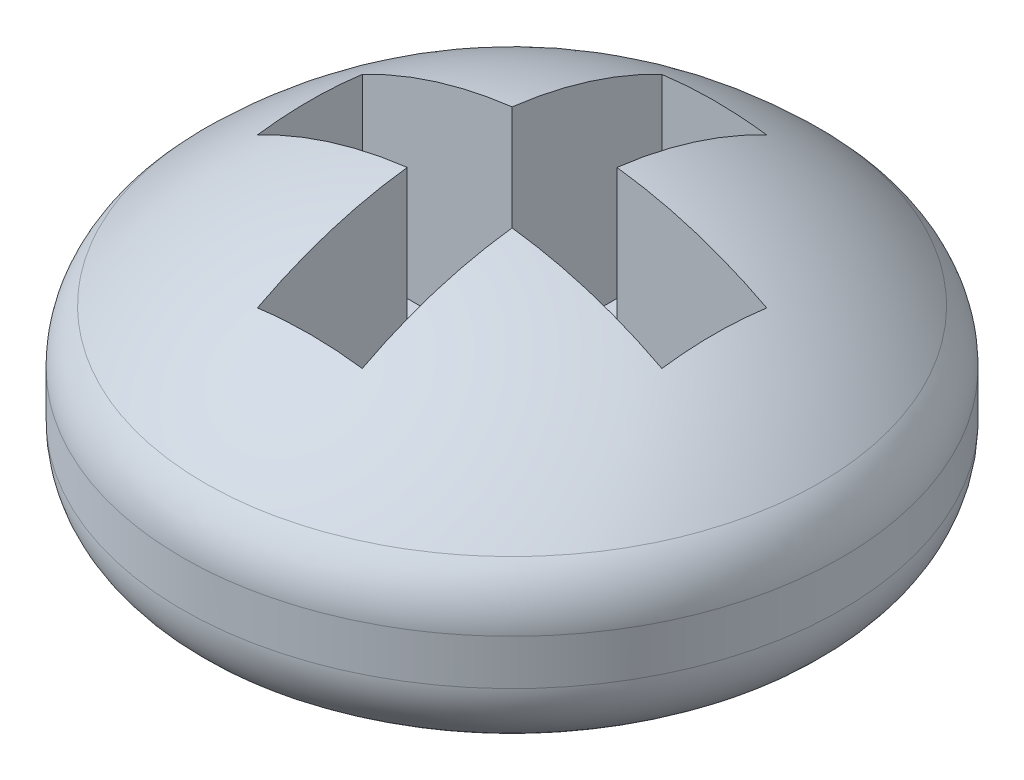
ISO-10303-21;
HEADER;
FILE_DESCRIPTION(('STEP AP214'),'2;1');
FILE_NAME('part.step','',(''),(''),'','','');
FILE_SCHEMA(('AUTOMOTIVE_DESIGN { 1 0 10303 214 1 1 1 1 }'));
ENDSEC;
DATA;
#1=APPLICATION_CONTEXT('core data for automotive mechanical design processes');
#2=APPLICATION_PROTOCOL_DEFINITION('international standard','automotive_design',2000,#1);
#3=PRODUCT_CONTEXT('',#1,'mechanical');
#4=PRODUCT('Part','Part','',(#3));
#5=PRODUCT_RELATED_PRODUCT_CATEGORY('part','',(#4));
#6=PRODUCT_DEFINITION_FORMATION('','',#4);
#7=PRODUCT_DEFINITION_CONTEXT('part definition',#1,'design');
#8=PRODUCT_DEFINITION('design','',#6,#7);
#9=PRODUCT_DEFINITION_SHAPE('','',#8);
#10=(LENGTH_UNIT() NAMED_UNIT(*) SI_UNIT(.MILLI.,.METRE.));
#11=(NAMED_UNIT(*) PLANE_ANGLE_UNIT() SI_UNIT($,.RADIAN.));
#12=(NAMED_UNIT(*) SI_UNIT($,.STERADIAN.) SOLID_ANGLE_UNIT());
#13=UNCERTAINTY_MEASURE_WITH_UNIT(LENGTH_MEASURE(1.E-05),#10,'distance_accuracy_value','');
#14=(GEOMETRIC_REPRESENTATION_CONTEXT(3) GLOBAL_UNCERTAINTY_ASSIGNED_CONTEXT((#13)) GLOBAL_UNIT_ASSIGNED_CONTEXT((#10,
#11,#12)) REPRESENTATION_CONTEXT('',''));
#15=CARTESIAN_POINT('',(0.,0.,0.));
#16=DIRECTION('',(0.,0.,1.));
#17=DIRECTION('',(1.,0.,0.));
#18=AXIS2_PLACEMENT_3D('',#15,#16,#17);
#19=CARTESIAN_POINT('',(0.,29.3099999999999,0.));
#20=DIRECTION('',(-1.,0.,0.));
#21=DIRECTION('',(0.,0.,-1.));
#22=AXIS2_PLACEMENT_3D('',#19,#20,#21);
#23=SPHERICAL_SURFACE('',#22,2.92);
#24=CARTESIAN_POINT('',(0.231169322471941,31.0323240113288,-2.18782100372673));
#25=CARTESIAN_POINT('',(0.231169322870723,31.2413439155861,-2.18782100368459));
#26=CARTESIAN_POINT('',(0.21553803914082,31.3881760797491,-2.03988419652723));
#27=CARTESIAN_POINT('',(0.108152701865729,31.0323240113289,-2.20081917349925));
#28=CARTESIAN_POINT('',(0.108152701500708,31.2413439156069,-2.20081917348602));
#29=CARTESIAN_POINT('',(0.100839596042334,31.3881760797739,-2.05200345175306));
#30=CARTESIAN_POINT('',(-0.015962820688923,31.0323240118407,-2.2034171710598));
#31=CARTESIAN_POINT('',(-0.0159628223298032,31.2413439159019,-2.20341717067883));
#32=CARTESIAN_POINT('',(-0.0148834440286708,31.3881760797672,-2.05442577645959));
#33=CARTESIAN_POINT('',(-0.26286840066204,31.0323240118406,-2.18773907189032));
#34=CARTESIAN_POINT('',(-0.262868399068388,31.2413439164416,-2.18773907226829));
#35=CARTESIAN_POINT('',(-0.245093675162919,31.3881760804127,-2.0398078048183));
#36=CARTESIAN_POINT('',(-0.385658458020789,31.0323240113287,-2.16946297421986));
#37=CARTESIAN_POINT('',(-0.385658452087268,31.2413439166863,-2.16946297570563));
#38=CARTESIAN_POINT('',(-0.359580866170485,31.3881760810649,-2.02276750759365));
#39=CARTESIAN_POINT('',(-0.626427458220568,31.0323240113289,-2.11255548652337));
#40=CARTESIAN_POINT('',(-0.626427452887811,31.2413439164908,-2.11255548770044));
#41=CARTESIAN_POINT('',(-0.584069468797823,31.388176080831,-1.96970800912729));
#42=CARTESIAN_POINT('',(-0.744406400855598,31.0323240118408,-2.07392409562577));
#43=CARTESIAN_POINT('',(-0.744406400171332,31.2413439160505,-2.07392409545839));
#44=CARTESIAN_POINT('',(-0.694070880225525,31.3881760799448,-1.93368880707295));
#45=CARTESIAN_POINT('',(-0.972204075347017,31.0323240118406,-1.97740265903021));
#46=CARTESIAN_POINT('',(-0.972204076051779,31.241343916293,-1.97740265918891));
#47=CARTESIAN_POINT('',(-0.906465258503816,31.3881760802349,-1.8436939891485));
#48=CARTESIAN_POINT('',(-1.08202280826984,31.0323240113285,-1.91951261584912));
#49=CARTESIAN_POINT('',(-1.08202280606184,31.2413439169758,-1.91951261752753));
#50=CARTESIAN_POINT('',(-1.00885822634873,31.3881760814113,-1.78971837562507));
#51=CARTESIAN_POINT('',(-1.29038263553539,31.0323240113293,-1.78611721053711));
#52=CARTESIAN_POINT('',(-1.29038263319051,31.2413439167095,-1.78611721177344));
#53=CARTESIAN_POINT('',(-1.20312910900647,31.3881760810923,-1.66534294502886));
#54=CARTESIAN_POINT('',(-1.38892373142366,31.0323240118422,-1.71061185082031));
#55=CARTESIAN_POINT('',(-1.38892373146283,31.2413439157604,-1.71061185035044));
#56=CARTESIAN_POINT('',(-1.29500702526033,31.3881760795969,-1.59494313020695));
#57=CARTESIAN_POINT('',(-1.57193104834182,31.0323240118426,-1.54412914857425));
#58=CARTESIAN_POINT('',(-1.5719310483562,31.2413439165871,-1.54412914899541));
#59=CARTESIAN_POINT('',(-1.4656396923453,31.3881760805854,-1.43971771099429));
#60=CARTESIAN_POINT('',(-1.65639726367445,31.0323240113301,-1.45315179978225));
#61=CARTESIAN_POINT('',(-1.6563972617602,31.241343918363,-1.45315180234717));
#62=CARTESIAN_POINT('',(-1.54439443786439,31.3881760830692,-1.35489210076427));
#63=CARTESIAN_POINT('',(-1.80885704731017,31.0323240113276,-1.25830768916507));
#64=CARTESIAN_POINT('',(-1.80885704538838,31.2413439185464,-1.25830769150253));
#65=CARTESIAN_POINT('',(-1.6865451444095,31.3881760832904,-1.17322302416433));
#66=CARTESIAN_POINT('',(-1.87685061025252,31.0323240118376,-1.15444092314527));
#67=CARTESIAN_POINT('',(-1.87685060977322,31.2413439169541,-1.15444092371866));
#68=CARTESIAN_POINT('',(-1.74994110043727,31.3881760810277,-1.07637955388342));
#69=CARTESIAN_POINT('',(-1.99443485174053,31.032324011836,-0.936766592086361));
#70=CARTESIAN_POINT('',(-1.99443485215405,31.2413439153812,-0.936766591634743));
#71=CARTESIAN_POINT('',(-1.85957449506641,31.3881760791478,-0.873423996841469));
#72=CARTESIAN_POINT('',(-2.04402554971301,31.0323240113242,-0.822959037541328));
#73=CARTESIAN_POINT('',(-2.04402554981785,31.2413439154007,-0.822959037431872));
#74=CARTESIAN_POINT('',(-1.905811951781,31.3881760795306,-0.767311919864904));
#75=CARTESIAN_POINT('',(-2.12339641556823,31.0323240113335,-0.588633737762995));
#76=CARTESIAN_POINT('',(-2.12339641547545,31.2413439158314,-0.588633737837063));
#77=CARTESIAN_POINT('',(-1.97981589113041,31.3881760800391,-0.548831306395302));
#78=CARTESIAN_POINT('',(-2.15317659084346,31.0323240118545,-0.468115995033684));
#79=CARTESIAN_POINT('',(-2.1531765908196,31.2413439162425,-0.468115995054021));
#80=CARTESIAN_POINT('',(-2.00758238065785,31.3881760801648,-0.43646277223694));
#81=CARTESIAN_POINT('',(-2.19208110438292,31.0323240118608,-0.223791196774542));
#82=CARTESIAN_POINT('',(-2.19208110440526,31.2413439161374,-0.223791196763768));
#83=CARTESIAN_POINT('',(-2.04385623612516,31.3881760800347,-0.208658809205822));
#84=CARTESIAN_POINT('',(-2.20120540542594,31.0323240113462,-0.0999841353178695));
#85=CARTESIAN_POINT('',(-2.20120540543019,31.2413439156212,-0.0999841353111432));
#86=CARTESIAN_POINT('',(-2.05236356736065,31.3881760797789,-0.0932233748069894));
#87=CARTESIAN_POINT('',(-2.19853905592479,31.0323240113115,0.147404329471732));
#88=CARTESIAN_POINT('',(-2.19853905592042,31.2413439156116,0.147404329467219));
#89=CARTESIAN_POINT('',(-2.04987751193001,31.3881760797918,0.137437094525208));
#90=CARTESIAN_POINT('',(-2.18674844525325,31.0323240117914,0.27098573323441));
#91=CARTESIAN_POINT('',(-2.18674844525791,31.2413439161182,0.270985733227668));
#92=CARTESIAN_POINT('',(-2.03888416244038,31.3881760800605,0.252662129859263));
#93=CARTESIAN_POINT('',(-2.14258698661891,31.032324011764,0.514415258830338));
#94=CARTESIAN_POINT('',(-2.14258698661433,31.2413439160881,0.514415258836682));
#95=CARTESIAN_POINT('',(-1.99770882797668,31.3881760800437,0.479631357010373));
#96=CARTESIAN_POINT('',(-2.11021609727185,31.0323240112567,0.634263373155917));
#97=CARTESIAN_POINT('',(-2.11021609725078,31.2413439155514,0.634263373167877));
#98=CARTESIAN_POINT('',(-1.96752680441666,31.3881760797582,0.591375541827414));
#99=CARTESIAN_POINT('',(-2.02581224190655,31.032324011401,0.866826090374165));
#100=CARTESIAN_POINT('',(-2.02581224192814,31.2413439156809,0.866826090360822));
#101=CARTESIAN_POINT('',(-1.88883019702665,31.3881760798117,0.80821275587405));
#102=CARTESIAN_POINT('',(-1.97377890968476,31.0323240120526,0.979540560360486));
#103=CARTESIAN_POINT('',(-1.97377890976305,31.2413439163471,0.979540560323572));
#104=CARTESIAN_POINT('',(-1.84031527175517,31.3881760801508,0.913305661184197));
#105=CARTESIAN_POINT('',(-1.85152947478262,31.0323240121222,1.19462957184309));
#106=CARTESIAN_POINT('',(-1.85152947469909,31.2413439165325,1.19462957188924));
#107=CARTESIAN_POINT('',(-1.7263321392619,31.3881760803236,1.11385071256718));
#108=CARTESIAN_POINT('',(-1.78131408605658,31.0323240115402,1.29700451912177));
#109=CARTESIAN_POINT('',(-1.78131408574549,31.2413439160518,1.29700451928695));
#110=CARTESIAN_POINT('',(-1.66086459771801,31.3881760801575,1.20930323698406));
#111=CARTESIAN_POINT('',(-1.62469149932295,31.0323240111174,1.48851624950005));
#112=CARTESIAN_POINT('',(-1.62469149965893,31.2413439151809,1.48851624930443));
#113=CARTESIAN_POINT('',(-1.51483257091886,31.388176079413,1.38786526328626));
#114=CARTESIAN_POINT('',(-1.53828382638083,31.0323240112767,1.57765264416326));
#115=CARTESIAN_POINT('',(-1.53828382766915,31.2413439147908,1.57765264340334));
#116=CARTESIAN_POINT('',(-1.4342676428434,31.3881760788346,1.47097440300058));
#117=CARTESIAN_POINT('',(-1.35172855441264,31.0323240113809,1.74015211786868));
#118=CARTESIAN_POINT('',(-1.35172855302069,31.2413439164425,1.74015211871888));
#119=CARTESIAN_POINT('',(-1.26032692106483,31.3881760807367,1.62248593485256));
#120=CARTESIAN_POINT('',(-1.25158122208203,31.0323240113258,1.81351550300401));
#121=CARTESIAN_POINT('',(-1.25158121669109,31.2413439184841,1.81351550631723));
#122=CARTESIAN_POINT('',(-1.16695137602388,31.3881760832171,1.69088861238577));
#123=CARTESIAN_POINT('',(-1.04033929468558,31.0323240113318,1.94242650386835));
#124=CARTESIAN_POINT('',(-1.04033928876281,31.2413439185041,1.9424265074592));
#125=CARTESIAN_POINT('',(-0.969993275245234,31.3881760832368,1.81108286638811));
#126=CARTESIAN_POINT('',(-0.92923804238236,31.0323240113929,1.99796319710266));
#127=CARTESIAN_POINT('',(-0.929238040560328,31.2413439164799,1.99796319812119));
#128=CARTESIAN_POINT('',(-0.866404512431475,31.388176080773,1.86286425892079));
#129=CARTESIAN_POINT('',(-0.69937579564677,31.0323240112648,2.08953200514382));
#130=CARTESIAN_POINT('',(-0.699375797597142,31.2413439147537,2.08953200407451));
#131=CARTESIAN_POINT('',(-0.652085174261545,31.3881760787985,1.94824133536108));
#132=CARTESIAN_POINT('',(-0.580624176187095,31.0323240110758,2.12558750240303));
#133=CARTESIAN_POINT('',(-0.5806241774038,31.2413439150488,2.12558750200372));
#134=CARTESIAN_POINT('',(-0.541363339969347,31.3881760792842,1.98185882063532));
#135=CARTESIAN_POINT('',(-0.384263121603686,31.0323240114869,2.16756087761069));
#136=CARTESIAN_POINT('',(-0.384263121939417,31.2413439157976,2.16756087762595));
#137=CARTESIAN_POINT('',(-0.358279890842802,31.388176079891,2.0209940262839));
#138=CARTESIAN_POINT('',(-0.307929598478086,31.0323240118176,2.17971036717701));
#139=CARTESIAN_POINT('',(-0.307929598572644,31.2413439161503,2.17971036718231));
#140=CARTESIAN_POINT('',(-0.287107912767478,31.3881760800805,2.03232198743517));
#141=CARTESIAN_POINT('',(-0.154409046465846,31.0323240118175,2.19593164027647));
#142=CARTESIAN_POINT('',(-0.154409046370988,31.2413439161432,2.19593164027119));
#143=CARTESIAN_POINT('',(-0.143968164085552,31.388176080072,2.04744640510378));
#144=CARTESIAN_POINT('',(-0.0772220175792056,31.0323240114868,2.20000342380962));
#145=CARTESIAN_POINT('',(-0.0772220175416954,31.2413439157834,2.20000342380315));
#146=CARTESIAN_POINT('',(-0.0720003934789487,31.388176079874,2.05124286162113));
#147=CARTESIAN_POINT('',(0.123574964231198,31.0323240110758,2.19999452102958));
#148=CARTESIAN_POINT('',(0.123574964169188,31.2413439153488,2.19999452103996));
#149=CARTESIAN_POINT('',(0.115219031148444,31.388176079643,2.05123456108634));
#150=CARTESIAN_POINT('',(0.247239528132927,31.0323240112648,2.18955317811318));
#151=CARTESIAN_POINT('',(0.247239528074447,31.2413439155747,2.18955317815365));
#152=CARTESIAN_POINT('',(0.230521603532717,31.3881760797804,2.04149924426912));
#153=CARTESIAN_POINT('',(0.491162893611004,31.0323240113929,2.14804545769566));
#154=CARTESIAN_POINT('',(0.491162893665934,31.2413439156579,2.14804545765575));
#155=CARTESIAN_POINT('',(0.457951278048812,31.3881760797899,2.00279820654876));
#156=CARTESIAN_POINT('',(0.611417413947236,31.0323240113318,2.1169542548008));
#157=CARTESIAN_POINT('',(0.611417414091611,31.2413439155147,2.11695425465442));
#158=CARTESIAN_POINT('',(0.570074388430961,31.3881760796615,1.97380933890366));
#159=CARTESIAN_POINT('',(0.844935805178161,31.0323240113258,2.03503747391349));
#160=CARTESIAN_POINT('',(0.84493580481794,31.2413439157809,2.03503747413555));
#161=CARTESIAN_POINT('',(0.787802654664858,31.3881760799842,1.89743163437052));
#162=CARTESIAN_POINT('',(0.958203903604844,31.0323240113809,1.98422396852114));
#163=CARTESIAN_POINT('',(0.95820390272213,31.2413439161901,1.98422396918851));
#164=CARTESIAN_POINT('',(0.893411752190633,31.3881760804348,1.85005405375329));
#165=CARTESIAN_POINT('',(1.17460045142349,31.0323240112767,1.86430114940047));
#166=CARTESIAN_POINT('',(1.1746004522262,31.2413439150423,1.86430114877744));
#167=CARTESIAN_POINT('',(1.095175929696,31.3881760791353,1.73824021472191));
#168=CARTESIAN_POINT('',(1.27772870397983,31.0323240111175,1.79519148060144));
#169=CARTESIAN_POINT('',(1.27772870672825,31.2413439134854,1.79519147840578));
#170=CARTESIAN_POINT('',(1.19133082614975,31.3881760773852,1.67380362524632));
#171=CARTESIAN_POINT('',(1.47091683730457,31.0323240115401,1.6406414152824));
#172=CARTESIAN_POINT('',(1.47091683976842,31.2413439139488,1.64064141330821));
#173=CARTESIAN_POINT('',(1.37145589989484,31.3881760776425,1.529703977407));
#174=CARTESIAN_POINT('',(1.56097710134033,31.0323240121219,1.555201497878));
#175=CARTESIAN_POINT('',(1.56097710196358,31.241343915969,1.55520149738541));
#176=CARTESIAN_POINT('',(1.45542643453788,31.3881760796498,1.45004136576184));
#177=CARTESIAN_POINT('',(1.72547855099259,31.0323240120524,1.3704111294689));
#178=CARTESIAN_POINT('',(1.72547855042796,31.2413439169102,1.37041112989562));
#179=CARTESIAN_POINT('',(1.60880456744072,31.3881760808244,1.27774621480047));
#180=CARTESIAN_POINT('',(1.79991912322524,31.0323240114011,1.27106013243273));
#181=CARTESIAN_POINT('',(1.79991912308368,31.2413439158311,1.27106013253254));
#182=CARTESIAN_POINT('',(1.67821159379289,31.3881760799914,1.18511316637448));
#183=CARTESIAN_POINT('',(1.93106255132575,31.032324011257,1.06127255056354));
#184=CARTESIAN_POINT('',(1.93106255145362,31.2413439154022,1.0612725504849));
#185=CARTESIAN_POINT('',(1.80048732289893,31.3881760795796,0.98951107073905));
#186=CARTESIAN_POINT('',(1.98776573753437,31.0323240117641,0.950836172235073));
#187=CARTESIAN_POINT('',(1.98776573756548,31.2413439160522,0.950836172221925));
#188=CARTESIAN_POINT('',(1.8533563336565,31.3881760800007,0.886542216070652));
#189=CARTESIAN_POINT('',(2.08182647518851,31.0323240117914,0.722011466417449));
#190=CARTESIAN_POINT('',(2.08182647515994,31.2413439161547,0.72201146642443));
#191=CARTESIAN_POINT('',(1.94105684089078,31.3881760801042,0.673190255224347));
#192=CARTESIAN_POINT('',(2.11918406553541,31.0323240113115,0.603623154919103));
#193=CARTESIAN_POINT('',(2.1191840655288,31.2413439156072,0.603623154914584));
#194=CARTESIAN_POINT('',(1.97588837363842,31.3881760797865,0.562807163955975));
#195=CARTESIAN_POINT('',(2.17349338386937,31.0323240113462,0.36225484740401));
#196=CARTESIAN_POINT('',(2.17349338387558,31.2413439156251,0.362254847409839));
#197=CARTESIAN_POINT('',(2.02652538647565,31.3881760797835,0.337759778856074));
#198=CARTESIAN_POINT('',(2.1904450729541,31.0323240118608,0.239274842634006));
#199=CARTESIAN_POINT('',(2.19044507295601,31.2413439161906,0.23927484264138));
#200=CARTESIAN_POINT('',(2.04233083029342,31.3881760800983,0.223095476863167));
#201=CARTESIAN_POINT('',(2.20346123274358,31.0323240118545,-0.0077853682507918));
#202=CARTESIAN_POINT('',(2.20346123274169,31.241343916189,-0.00778536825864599));
#203=CARTESIAN_POINT('',(2.05446685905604,31.3881760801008,-0.00725893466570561));
#204=CARTESIAN_POINT('',(2.19952574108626,31.0323240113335,-0.131865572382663));
#205=CARTESIAN_POINT('',(2.19952574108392,31.2413439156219,-0.131865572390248));
#206=CARTESIAN_POINT('',(2.05079747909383,31.3881760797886,-0.122949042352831));
#207=CARTESIAN_POINT('',(2.17087933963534,31.0323240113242,-0.377604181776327));
#208=CARTESIAN_POINT('',(2.17087933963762,31.2413439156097,-0.37760418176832));
#209=CARTESIAN_POINT('',(2.02408809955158,31.3881760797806,-0.352071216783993));
#210=CARTESIAN_POINT('',(2.14616842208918,31.0323240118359,-0.499262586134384));
#211=CARTESIAN_POINT('',(2.14616842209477,31.2413439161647,-0.49926258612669));
#212=CARTESIAN_POINT('',(2.00104809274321,31.3881760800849,-0.465503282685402));
#213=CARTESIAN_POINT('',(2.07667259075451,31.0323240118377,-0.736704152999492));
#214=CARTESIAN_POINT('',(2.07667259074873,31.2413439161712,-0.736704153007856));
#215=CARTESIAN_POINT('',(1.93625145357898,31.3881760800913,-0.686889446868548));
#216=CARTESIAN_POINT('',(2.031887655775,31.0323240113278,-0.852487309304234));
#217=CARTESIAN_POINT('',(2.03188765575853,31.2413439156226,-0.852487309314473));
#218=CARTESIAN_POINT('',(1.89449480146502,31.3881760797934,-0.794843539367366));
#219=CARTESIAN_POINT('',(1.92351511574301,31.0323240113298,-1.07489145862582));
#220=CARTESIAN_POINT('',(1.92351511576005,31.24134391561,-1.07489145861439));
#221=CARTESIAN_POINT('',(1.79345023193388,31.3881760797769,-1.00220909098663));
#222=CARTESIAN_POINT('',(1.85992751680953,31.0323240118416,-1.18151245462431));
#223=CARTESIAN_POINT('',(1.85992751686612,31.2413439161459,-1.18151245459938));
#224=CARTESIAN_POINT('',(1.73416232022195,31.3881760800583,-1.10162055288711));
#225=CARTESIAN_POINT('',(1.71575473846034,31.0323240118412,-1.38256562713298));
#226=CARTESIAN_POINT('',(1.71575473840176,31.2413439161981,-1.38256562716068));
#227=CARTESIAN_POINT('',(1.59973826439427,31.388176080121,-1.28907884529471));
#228=CARTESIAN_POINT('',(1.63516956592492,31.0323240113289,-1.47699780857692));
#229=CARTESIAN_POINT('',(1.63516956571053,31.2413439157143,-1.47699780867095));
#230=CARTESIAN_POINT('',(1.52460212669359,31.3881760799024,-1.37712568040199));
#231=CARTESIAN_POINT('',(1.45928918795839,31.0323240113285,-1.65099276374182));
#232=CARTESIAN_POINT('',(1.45928918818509,31.241343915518,-1.65099276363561));
#233=CARTESIAN_POINT('',(1.36061448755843,31.3881760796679,-1.53935538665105));
#234=CARTESIAN_POINT('',(1.36399398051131,31.0323240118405,-1.73055553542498));
#235=CARTESIAN_POINT('',(1.36399398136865,31.2413439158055,-1.73055553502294));
#236=CARTESIAN_POINT('',(1.27176298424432,31.3881760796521,-1.61353825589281));
#237=CARTESIAN_POINT('',(1.16139867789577,31.0323240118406,-1.87255311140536));
#238=CARTESIAN_POINT('',(1.16139867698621,31.2413439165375,-1.872553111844));
#239=CARTESIAN_POINT('',(1.08286683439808,31.3881760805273,-1.74593419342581));
#240=CARTESIAN_POINT('',(1.05409858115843,31.0323240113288,-1.93498791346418));
#241=CARTESIAN_POINT('',(1.05409857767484,31.2413439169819,-1.93498791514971));
#242=CARTESIAN_POINT('',(0.98282218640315,31.3881760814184,-1.80414725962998));
#243=CARTESIAN_POINT('',(0.830539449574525,31.0323240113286,-2.04095719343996));
#244=CARTESIAN_POINT('',(0.830539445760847,31.241343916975,-2.04095719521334));
#245=CARTESIAN_POINT('',(0.774379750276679,31.3881760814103,-1.90295107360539));
#246=CARTESIAN_POINT('',(0.71428041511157,31.0323240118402,-2.08449167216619));
#247=CARTESIAN_POINT('',(0.714280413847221,31.2413439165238,-2.08449167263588));
#248=CARTESIAN_POINT('',(0.6659819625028,31.3881760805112,-1.94354182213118));
#249=CARTESIAN_POINT('',(0.476103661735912,31.0323240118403,-2.15142449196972));
#250=CARTESIAN_POINT('',(0.476103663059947,31.241343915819,-2.15142449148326));
#251=CARTESIAN_POINT('',(0.44391032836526,31.3881760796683,-2.00594875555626));
#252=CARTESIAN_POINT('',(0.354185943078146,31.0323240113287,-2.17482283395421));
#253=CARTESIAN_POINT('',(0.354185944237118,31.2413439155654,-2.17482283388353));
#254=CARTESIAN_POINT('',(0.330236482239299,31.3881760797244,-2.0277649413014));
#255=CARTESIAN_POINT('',(0.231169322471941,31.0323240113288,-2.18782100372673));
#256=CARTESIAN_POINT('',(0.231169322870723,31.2413439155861,-2.18782100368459));
#257=CARTESIAN_POINT('',(0.21553803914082,31.3881760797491,-2.03988419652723));
#258=(BOUNDED_SURFACE() B_SPLINE_SURFACE(3,2,((#24,#25,#26),(#27,#28,#29),(#30,#31,#32),(#33,
#34,#35),(#36,#37,#38),(#39,#40,#41),(#42,#43,#44),(#45,#46,#47),(#48,#49,#50),(#51,#52,#53),
(#54,#55,#56),(#57,#58,#59),(#60,#61,#62),(#63,#64,#65),(#66,#67,#68),(#69,#70,#71),(#72,#73,
#74),(#75,#76,#77),(#78,#79,#80),(#81,#82,#83),(#84,#85,#86),(#87,#88,#89),(#90,#91,#92),(#93,
#94,#95),(#96,#97,#98),(#99,#100,#101),(#102,#103,#104),(#105,#106,#107),(#108,#109,#110),(#111,
#112,#113),(#114,#115,#116),(#117,#118,#119),(#120,#121,#122),(#123,#124,#125),(#126,#127,#128),
(#129,#130,#131),(#132,#133,#134),(#135,#136,#137),(#138,#139,#140),(#141,#142,#143),(#144,#145,
#146),(#147,#148,#149),(#150,#151,#152),(#153,#154,#155),(#156,#157,#158),(#159,#160,#161),
(#162,#163,#164),(#165,#166,#167),(#168,#169,#170),(#171,#172,#173),(#174,#175,#176),(#177,#178,
#179),(#180,#181,#182),(#183,#184,#185),(#186,#187,#188),(#189,#190,#191),(#192,#193,#194),
(#195,#196,#197),(#198,#199,#200),(#201,#202,#203),(#204,#205,#206),(#207,#208,#209),(#210,#211,
#212),(#213,#214,#215),(#216,#217,#218),(#219,#220,#221),(#222,#223,#224),(#225,#226,#227),
(#228,#229,#230),(#231,#232,#233),(#234,#235,#236),(#237,#238,#239),(#240,#241,#242),(#243,#244,
#245),(#246,#247,#248),(#249,#250,#251),(#252,#253,#254),(#255,#256,#257)),.UNSPECIFIED.,.T.,
.F.,.F.) B_SPLINE_SURFACE_WITH_KNOTS((4,2,2,2,2,2,2,2,2,2,2,2,2,2,2,2,2,2,2,2,2,2,2,2,2,2,2,2,2,
2,2,2,2,2,2,2,2,2,4),(3,3),(0.,0.286423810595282,0.572847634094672,0.859271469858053,
1.14569526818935,1.43211902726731,1.71854290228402,2.00496687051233,2.2913905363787,
2.57781409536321,2.8642381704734,3.15066169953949,3.43708580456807,3.72351524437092,
4.00993343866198,4.29636003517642,4.58278107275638,4.86937726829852,5.15562870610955,
5.33450728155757,5.51338585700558,5.7996372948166,6.08623349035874,6.37265452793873,
6.65908112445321,6.94549931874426,7.23192875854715,7.51835286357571,7.80477639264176,
8.09120046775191,8.37762402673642,8.6640476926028,8.95047166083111,9.23689553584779,
9.52331929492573,9.80974309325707,10.0961669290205,10.3825907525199,10.6690145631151),(0.,1.),
.UNSPECIFIED.) GEOMETRIC_REPRESENTATION_ITEM() RATIONAL_B_SPLINE_SURFACE(((1.,0.922626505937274,
1.),(1.,0.922626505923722,1.),(1.,0.922626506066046,1.),(1.,0.922626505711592,1.),(1.,
0.922626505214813,1.),(1.,0.922626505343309,1.),(1.,0.922626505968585,1.),(1.,0.922626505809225,
1.),(1.,0.922626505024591,1.),(1.,0.922626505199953,1.),(1.,0.922626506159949,1.),(1.,
0.922626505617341,1.),(1.,0.922626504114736,1.),(1.,0.922626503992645,1.),(1.,0.922626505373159,
1.),(1.,0.922626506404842,1.),(1.,0.922626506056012,1.),(1.,0.922626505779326,1.),(1.,
0.92262650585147,1.),(1.,0.922626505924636,1.),(1.,0.922626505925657,1.),(1.,0.922626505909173,
1.),(1.,0.922626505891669,1.),(1.,0.922626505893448,1.),(1.,0.922626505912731,1.),(1.,
0.922626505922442,1.),(1.,0.922626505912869,1.),(1.,0.922626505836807,1.),(1.,0.922626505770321,
1.),(1.,0.922626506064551,1.),(1.,0.922626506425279,1.),(1.,0.922626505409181,1.),(1.,
0.922626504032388,1.),(1.,0.922626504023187,1.),(1.,0.922626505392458,1.),(1.,0.922626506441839,
1.),(1.,0.92262650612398,1.),(1.,0.92262650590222,1.),(1.,0.922626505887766,1.),(1.,
0.922626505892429,1.),(1.,0.922626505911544,1.),(1.,0.922626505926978,1.),(1.,0.922626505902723,
1.),(1.,0.922626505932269,1.),(1.,0.922626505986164,1.),(1.,0.922626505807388,1.),(1.,
0.922626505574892,1.),(1.,0.922626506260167,1.),(1.,0.922626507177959,1.),(1.,0.922626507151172,
1.),(1.,0.922626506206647,1.),(1.,0.922626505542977,1.),(1.,0.92262650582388,1.),(1.,
0.922626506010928,1.),(1.,0.922626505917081,1.),(1.,0.922626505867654,1.),(1.,0.922626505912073,
1.),(1.,0.922626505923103,1.),(1.,0.922626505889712,1.),(1.,0.922626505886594,1.),(1.,
0.922626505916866,1.),(1.,0.922626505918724,1.),(1.,0.922626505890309,1.),(1.,0.922626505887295,
1.),(1.,0.922626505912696,1.),(1.,0.922626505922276,1.),(1.,0.922626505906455,1.),(1.,
0.922626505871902,1.),(1.,0.922626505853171,1.),(1.,0.922626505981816,1.),(1.,0.922626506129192,
1.),(1.,0.922626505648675,1.),(1.,0.922626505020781,1.),(1.,0.922626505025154,1.),(1.,
0.922626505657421,1.),(1.,0.922626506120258,1.),(1.,0.922626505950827,1.),(1.,0.922626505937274,1.))) REPRESENTATION_ITEM('') SURFACE());
#259=CARTESIAN_POINT('',(0.21553803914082,31.3881760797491,-2.03988419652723));
#260=CARTESIAN_POINT('',(0.100839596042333,31.3881760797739,-2.05200345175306));
#261=CARTESIAN_POINT('',(-0.014883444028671,31.3881760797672,-2.05442577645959));
#262=CARTESIAN_POINT('',(-0.245093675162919,31.3881760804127,-2.0398078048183));
#263=CARTESIAN_POINT('',(-0.359580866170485,31.388176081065,-2.02276750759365));
#264=CARTESIAN_POINT('',(-0.584069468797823,31.388176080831,-1.96970800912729));
#265=CARTESIAN_POINT('',(-0.694070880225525,31.3881760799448,-1.93368880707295));
#266=CARTESIAN_POINT('',(-0.906465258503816,31.3881760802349,-1.8436939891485));
#267=CARTESIAN_POINT('',(-1.00885822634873,31.3881760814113,-1.78971837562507));
#268=CARTESIAN_POINT('',(-1.20312910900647,31.3881760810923,-1.66534294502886));
#269=CARTESIAN_POINT('',(-1.29500702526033,31.3881760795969,-1.59494313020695));
#270=CARTESIAN_POINT('',(-1.4656396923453,31.3881760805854,-1.43971771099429));
#271=CARTESIAN_POINT('',(-1.54439443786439,31.3881760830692,-1.35489210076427));
#272=CARTESIAN_POINT('',(-1.6865451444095,31.3881760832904,-1.17322302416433));
#273=CARTESIAN_POINT('',(-1.74994110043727,31.3881760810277,-1.07637955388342));
#274=CARTESIAN_POINT('',(-1.85957449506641,31.3881760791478,-0.873423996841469));
#275=CARTESIAN_POINT('',(-1.905811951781,31.3881760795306,-0.767311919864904));
#276=CARTESIAN_POINT('',(-1.97981589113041,31.3881760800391,-0.548831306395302));
#277=CARTESIAN_POINT('',(-2.00758238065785,31.3881760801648,-0.43646277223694));
#278=CARTESIAN_POINT('',(-2.04385623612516,31.3881760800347,-0.208658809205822));
#279=CARTESIAN_POINT('',(-2.05236356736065,31.3881760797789,-0.0932233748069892));
#280=CARTESIAN_POINT('',(-2.04987751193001,31.3881760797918,0.137437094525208));
#281=CARTESIAN_POINT('',(-2.03888416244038,31.3881760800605,0.252662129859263));
#282=CARTESIAN_POINT('',(-1.99770882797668,31.3881760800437,0.479631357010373));
#283=CARTESIAN_POINT('',(-1.96752680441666,31.3881760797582,0.591375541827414));
#284=CARTESIAN_POINT('',(-1.88883019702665,31.3881760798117,0.80821275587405));
#285=CARTESIAN_POINT('',(-1.84031527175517,31.3881760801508,0.913305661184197));
#286=CARTESIAN_POINT('',(-1.7263321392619,31.3881760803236,1.11385071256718));
#287=CARTESIAN_POINT('',(-1.66086459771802,31.3881760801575,1.20930323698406));
#288=CARTESIAN_POINT('',(-1.51483257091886,31.388176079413,1.38786526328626));
#289=CARTESIAN_POINT('',(-1.4342676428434,31.3881760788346,1.47097440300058));
#290=CARTESIAN_POINT('',(-1.26032692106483,31.3881760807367,1.62248593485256));
#291=CARTESIAN_POINT('',(-1.16695137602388,31.3881760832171,1.69088861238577));
#292=CARTESIAN_POINT('',(-0.969993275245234,31.3881760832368,1.81108286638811));
#293=CARTESIAN_POINT('',(-0.866404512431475,31.388176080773,1.86286425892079));
#294=CARTESIAN_POINT('',(-0.652085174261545,31.3881760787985,1.94824133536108));
#295=CARTESIAN_POINT('',(-0.541363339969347,31.3881760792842,1.98185882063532));
#296=CARTESIAN_POINT('',(-0.358279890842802,31.388176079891,2.0209940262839));
#297=CARTESIAN_POINT('',(-0.287107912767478,31.3881760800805,2.03232198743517));
#298=CARTESIAN_POINT('',(-0.143968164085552,31.388176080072,2.04744640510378));
#299=CARTESIAN_POINT('',(-0.0720003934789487,31.388176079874,2.05124286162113));
#300=CARTESIAN_POINT('',(0.115219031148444,31.388176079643,2.05123456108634));
#301=CARTESIAN_POINT('',(0.230521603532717,31.3881760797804,2.04149924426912));
#302=CARTESIAN_POINT('',(0.457951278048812,31.3881760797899,2.00279820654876));
#303=CARTESIAN_POINT('',(0.57007438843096,31.3881760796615,1.97380933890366));
#304=CARTESIAN_POINT('',(0.787802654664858,31.3881760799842,1.89743163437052));
#305=CARTESIAN_POINT('',(0.893411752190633,31.3881760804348,1.85005405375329));
#306=CARTESIAN_POINT('',(1.095175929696,31.3881760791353,1.73824021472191));
#307=CARTESIAN_POINT('',(1.19133082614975,31.3881760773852,1.67380362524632));
#308=CARTESIAN_POINT('',(1.37145589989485,31.3881760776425,1.529703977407));
#309=CARTESIAN_POINT('',(1.45542643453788,31.3881760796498,1.45004136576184));
#310=CARTESIAN_POINT('',(1.60880456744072,31.3881760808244,1.27774621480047));
#311=CARTESIAN_POINT('',(1.67821159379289,31.3881760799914,1.18511316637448));
#312=CARTESIAN_POINT('',(1.80048732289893,31.3881760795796,0.98951107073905));
#313=CARTESIAN_POINT('',(1.8533563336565,31.3881760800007,0.886542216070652));
#314=CARTESIAN_POINT('',(1.94105684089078,31.3881760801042,0.673190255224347));
#315=CARTESIAN_POINT('',(1.97588837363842,31.3881760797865,0.562807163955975));
#316=CARTESIAN_POINT('',(2.02652538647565,31.3881760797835,0.337759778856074));
#317=CARTESIAN_POINT('',(2.04233083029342,31.3881760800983,0.223095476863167));
#318=CARTESIAN_POINT('',(2.05446685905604,31.3881760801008,-0.00725893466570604));
#319=CARTESIAN_POINT('',(2.05079747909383,31.3881760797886,-0.122949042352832));
#320=CARTESIAN_POINT('',(2.02408809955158,31.3881760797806,-0.352071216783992));
#321=CARTESIAN_POINT('',(2.00104809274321,31.3881760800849,-0.465503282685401));
#322=CARTESIAN_POINT('',(1.93625145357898,31.3881760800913,-0.686889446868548));
#323=CARTESIAN_POINT('',(1.89449480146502,31.3881760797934,-0.794843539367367));
#324=CARTESIAN_POINT('',(1.79345023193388,31.3881760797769,-1.00220909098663));
#325=CARTESIAN_POINT('',(1.73416232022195,31.3881760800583,-1.10162055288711));
#326=CARTESIAN_POINT('',(1.59973826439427,31.388176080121,-1.28907884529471));
#327=CARTESIAN_POINT('',(1.52460212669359,31.3881760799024,-1.37712568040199));
#328=CARTESIAN_POINT('',(1.36061448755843,31.3881760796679,-1.53935538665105));
#329=CARTESIAN_POINT('',(1.27176298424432,31.3881760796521,-1.61353825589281));
#330=CARTESIAN_POINT('',(1.08286683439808,31.3881760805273,-1.74593419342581));
#331=CARTESIAN_POINT('',(0.98282218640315,31.3881760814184,-1.80414725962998));
#332=CARTESIAN_POINT('',(0.774379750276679,31.3881760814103,-1.90295107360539));
#333=CARTESIAN_POINT('',(0.665981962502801,31.3881760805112,-1.94354182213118));
#334=CARTESIAN_POINT('',(0.443910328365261,31.3881760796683,-2.00594875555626));
#335=CARTESIAN_POINT('',(0.330236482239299,31.3881760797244,-2.0277649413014));
#336=CARTESIAN_POINT('',(0.21553803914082,31.3881760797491,-2.03988419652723));
#337=B_SPLINE_CURVE_WITH_KNOTS('',3,(#259,#260,#261,#262,#263,#264,#265,#266,#267,#268,#269,
#270,#271,#272,#273,#274,#275,#276,#277,#278,#279,#280,#281,#282,#283,#284,#285,#286,#287,#288,
#289,#290,#291,#292,#293,#294,#295,#296,#297,#298,#299,#300,#301,#302,#303,#304,#305,#306,#307,
#308,#309,#310,#311,#312,#313,#314,#315,#316,#317,#318,#319,#320,#321,#322,#323,#324,#325,#326,
#327,#328,#329,#330,#331,#332,#333,#334,#335,#336),.UNSPECIFIED.,.T.,.F.,(4,2,2,2,2,2,2,2,2,2,2,
2,2,2,2,2,2,2,2,2,2,2,2,2,2,2,2,2,2,2,2,2,2,2,2,2,2,2,4),(0.,0.286423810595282,
0.572847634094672,0.859271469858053,1.14569526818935,1.43211902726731,1.71854290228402,
2.00496687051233,2.2913905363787,2.57781409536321,2.8642381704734,3.15066169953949,
3.43708580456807,3.72351524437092,4.00993343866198,4.29636003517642,4.58278107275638,
4.86937726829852,5.15562870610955,5.33450728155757,5.51338585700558,5.7996372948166,
6.08623349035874,6.37265452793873,6.65908112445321,6.94549931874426,7.23192875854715,
7.51835286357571,7.80477639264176,8.09120046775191,8.37762402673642,8.6640476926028,
8.95047166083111,9.23689553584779,9.52331929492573,9.80974309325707,10.0961669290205,
10.3825907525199,10.6690145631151),.UNSPECIFIED.);
#338=CARTESIAN_POINT('',(0.21553803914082,31.3881760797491,-2.03988419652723));
#339=VERTEX_POINT('',#338);
#340=EDGE_CURVE('E13',#339,#339,#337,.T.);
#341=ORIENTED_EDGE('',*,*,#340,.T.);
#342=EDGE_LOOP('',(#341));
#343=FACE_BOUND('',#342,.T.);
#344=CARTESIAN_POINT('',(0.350000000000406,31.8754239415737,1.35000000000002));
#345=CARTESIAN_POINT('',(0.311218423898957,31.8807155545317,1.34999999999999));
#346=CARTESIAN_POINT('',(0.272316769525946,31.8851264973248,1.34999999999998));
#347=CARTESIAN_POINT('',(0.194512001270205,31.8921664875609,1.34999999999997));
#348=CARTESIAN_POINT('',(0.155609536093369,31.8948027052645,1.34999999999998));
#349=CARTESIAN_POINT('',(0.0778046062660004,31.8983122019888,1.34999999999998));
#350=CARTESIAN_POINT('',(0.0389023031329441,31.8991890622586,1.34999999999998));
#351=CARTESIAN_POINT('',(-0.0389023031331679,31.8991890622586,1.34999999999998));
#352=CARTESIAN_POINT('',(-0.0778046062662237,31.8983122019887,1.34999999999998));
#353=CARTESIAN_POINT('',(-0.155609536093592,31.8948027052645,1.34999999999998));
#354=CARTESIAN_POINT('',(-0.194512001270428,31.8921664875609,1.34999999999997));
#355=CARTESIAN_POINT('',(-0.272316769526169,31.8851264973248,1.34999999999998));
#356=CARTESIAN_POINT('',(-0.311218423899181,31.8807155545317,1.34999999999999));
#357=CARTESIAN_POINT('',(-0.350000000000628,31.8754239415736,1.35000000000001));
#358=B_SPLINE_CURVE_WITH_KNOTS('',3,(#344,#345,#346,#347,#348,#349,#350,#351,#352,#353,#354,
#355,#356,#357),.UNSPECIFIED.,.F.,.F.,(4,2,2,2,2,2,4),(0.,0.11741256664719,0.234347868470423,
0.3510449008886,0.467741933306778,0.58467723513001,0.702089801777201),.UNSPECIFIED.);
#359=CARTESIAN_POINT('',(0.34999999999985,31.8754239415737,1.35000000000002));
#360=VERTEX_POINT('',#359);
#361=CARTESIAN_POINT('',(-0.350000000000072,31.8754239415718,1.35000000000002));
#362=VERTEX_POINT('',#361);
#363=EDGE_CURVE('E155',#360,#362,#358,.T.);
#364=ORIENTED_EDGE('',*,*,#363,.T.);
#365=CARTESIAN_POINT('',(-0.350000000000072,29.3099999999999,0.));
#366=DIRECTION('',(-1.,0.,0.));
#367=DIRECTION('',(0.,0.,1.));
#368=AXIS2_PLACEMENT_3D('',#365,#366,#367);
#369=CIRCLE('',#368,2.89894808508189);
#370=CARTESIAN_POINT('',(-0.350000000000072,32.1877421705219,0.350000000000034));
#371=VERTEX_POINT('',#370);
#372=EDGE_CURVE('E182',#362,#371,#369,.T.);
#373=ORIENTED_EDGE('',*,*,#372,.T.);
#374=CARTESIAN_POINT('',(-0.350000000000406,32.1877421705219,0.350000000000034));
#375=CARTESIAN_POINT('',(-0.393885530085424,32.1824054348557,0.34999999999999));
#376=CARTESIAN_POINT('',(-0.437648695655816,32.1760633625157,0.349999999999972));
#377=CARTESIAN_POINT('',(-0.524571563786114,32.1614301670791,0.349999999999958));
#378=CARTESIAN_POINT('',(-0.567733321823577,32.1531512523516,0.349999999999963));
#379=CARTESIAN_POINT('',(-0.653460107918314,32.1346778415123,0.349999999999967));
#380=CARTESIAN_POINT('',(-0.69602685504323,32.1244913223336,0.349999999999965));
#381=CARTESIAN_POINT('',(-0.780568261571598,32.1022249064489,0.349999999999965));
#382=CARTESIAN_POINT('',(-0.822543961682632,32.0901489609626,0.349999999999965));
#383=CARTESIAN_POINT('',(-0.905906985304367,32.0641131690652,0.349999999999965));
#384=CARTESIAN_POINT('',(-0.947294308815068,32.0501533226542,0.349999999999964));
#385=CARTESIAN_POINT('',(-1.02948102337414,32.020347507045,0.349999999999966));
#386=CARTESIAN_POINT('',(-1.07027902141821,32.0044976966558,0.349999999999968));
#387=CARTESIAN_POINT('',(-1.15128173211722,31.970898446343,0.349999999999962));
#388=CARTESIAN_POINT('',(-1.19148331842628,31.953141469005,0.349999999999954));
#389=CARTESIAN_POINT('',(-1.27128395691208,31.9157038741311,0.349999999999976));
#390=CARTESIAN_POINT('',(-1.31087775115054,31.8960120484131,0.350000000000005));
#391=CARTESIAN_POINT('',(-1.35000000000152,31.875423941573,0.350000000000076));
#392=B_SPLINE_CURVE_WITH_KNOTS('',3,(#374,#375,#376,#377,#378,#379,#380,#381,#382,#383,#384,
#385,#386,#387,#388,#389,#390,#391),.UNSPECIFIED.,.F.,.F.,(4,2,2,2,2,2,2,2,4),(0.,
0.132614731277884,0.264415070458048,0.395676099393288,0.526666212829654,0.657656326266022,
0.788917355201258,0.92071769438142,1.05333242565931),.UNSPECIFIED.);
#393=CARTESIAN_POINT('',(-1.34999999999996,31.8754239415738,0.350000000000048));
#394=VERTEX_POINT('',#393);
#395=EDGE_CURVE('E69',#371,#394,#392,.T.);
#396=ORIENTED_EDGE('',*,*,#395,.T.);
#397=CARTESIAN_POINT('',(-1.34999999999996,29.3099999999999,0.));
#398=DIRECTION('',(-1.,0.,0.));
#399=DIRECTION('',(0.,0.,1.));
#400=AXIS2_PLACEMENT_3D('',#397,#398,#399);
#401=CIRCLE('',#400,2.58918906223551);
#402=CARTESIAN_POINT('',(-1.34999999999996,31.8754239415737,-0.349999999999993));
#403=VERTEX_POINT('',#402);
#404=EDGE_CURVE('E221',#394,#403,#401,.T.);
#405=ORIENTED_EDGE('',*,*,#404,.T.);
#406=CARTESIAN_POINT('',(-1.35000000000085,31.8754239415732,-0.350000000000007));
#407=CARTESIAN_POINT('',(-1.31087775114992,31.8960120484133,-0.349999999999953));
#408=CARTESIAN_POINT('',(-1.27128395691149,31.9157038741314,-0.349999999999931));
#409=CARTESIAN_POINT('',(-1.19148331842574,31.9531414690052,-0.349999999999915));
#410=CARTESIAN_POINT('',(-1.1512817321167,31.9708984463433,-0.349999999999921));
#411=CARTESIAN_POINT('',(-1.07027902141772,32.004497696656,-0.349999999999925));
#412=CARTESIAN_POINT('',(-1.02948102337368,32.0203475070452,-0.349999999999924));
#413=CARTESIAN_POINT('',(-0.947294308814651,32.0501533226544,-0.349999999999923));
#414=CARTESIAN_POINT('',(-0.905906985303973,32.0641131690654,-0.349999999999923));
#415=CARTESIAN_POINT('',(-0.822543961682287,32.0901489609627,-0.349999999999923));
#416=CARTESIAN_POINT('',(-0.780568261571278,32.102224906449,-0.349999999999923));
#417=CARTESIAN_POINT('',(-0.69602685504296,32.1244913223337,-0.349999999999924));
#418=CARTESIAN_POINT('',(-0.653460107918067,32.1346778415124,-0.349999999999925));
#419=CARTESIAN_POINT('',(-0.567733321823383,32.1531512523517,-0.349999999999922));
#420=CARTESIAN_POINT('',(-0.524571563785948,32.1614301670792,-0.349999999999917));
#421=CARTESIAN_POINT('',(-0.437648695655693,32.1760633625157,-0.34999999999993));
#422=CARTESIAN_POINT('',(-0.393885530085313,32.1824054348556,-0.349999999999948));
#423=CARTESIAN_POINT('',(-0.350000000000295,32.1877421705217,-0.349999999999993));
#424=B_SPLINE_CURVE_WITH_KNOTS('',3,(#406,#407,#408,#409,#410,#411,#412,#413,#414,#415,#416,
#417,#418,#419,#420,#421,#422,#423),.UNSPECIFIED.,.F.,.F.,(4,2,2,2,2,2,2,2,4),(0.,
0.132614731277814,0.264415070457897,0.395676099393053,0.526666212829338,0.657656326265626,
0.788917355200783,0.920717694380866,1.05333242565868),.UNSPECIFIED.);
#425=CARTESIAN_POINT('',(-0.350000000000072,32.1877421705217,-0.35));
#426=VERTEX_POINT('',#425);
#427=EDGE_CURVE('E218',#403,#426,#424,.T.);
#428=ORIENTED_EDGE('',*,*,#427,.T.);
#429=CARTESIAN_POINT('',(-0.350000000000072,29.3099999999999,0.));
#430=DIRECTION('',(-1.,0.,0.));
#431=DIRECTION('',(0.,0.,1.));
#432=AXIS2_PLACEMENT_3D('',#429,#430,#431);
#433=CIRCLE('',#432,2.89894808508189);
#434=CARTESIAN_POINT('',(-0.350000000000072,31.8754239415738,-1.35));
#435=VERTEX_POINT('',#434);
#436=EDGE_CURVE('E215',#426,#435,#433,.T.);
#437=ORIENTED_EDGE('',*,*,#436,.T.);
#438=CARTESIAN_POINT('',(-0.350000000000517,31.8754239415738,-1.35));
#439=CARTESIAN_POINT('',(-0.31121842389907,31.8807155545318,-1.34999999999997));
#440=CARTESIAN_POINT('',(-0.272316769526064,31.8851264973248,-1.34999999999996));
#441=CARTESIAN_POINT('',(-0.194512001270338,31.8921664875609,-1.34999999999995));
#442=CARTESIAN_POINT('',(-0.155609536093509,31.8948027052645,-1.34999999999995));
#443=CARTESIAN_POINT('',(-0.0778046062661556,31.8983122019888,-1.34999999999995));
#444=CARTESIAN_POINT('',(-0.0389023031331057,31.8991890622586,-1.34999999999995));
#445=CARTESIAN_POINT('',(0.0389023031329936,31.8991890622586,-1.34999999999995));
#446=CARTESIAN_POINT('',(0.0778046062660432,31.8983122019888,-1.34999999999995));
#447=CARTESIAN_POINT('',(0.155609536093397,31.8948027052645,-1.34999999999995));
#448=CARTESIAN_POINT('',(0.194512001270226,31.8921664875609,-1.34999999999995));
#449=CARTESIAN_POINT('',(0.272316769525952,31.8851264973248,-1.34999999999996));
#450=CARTESIAN_POINT('',(0.311218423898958,31.8807155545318,-1.34999999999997));
#451=CARTESIAN_POINT('',(0.350000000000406,31.8754239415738,-1.35));
#452=B_SPLINE_CURVE_WITH_KNOTS('',3,(#438,#439,#440,#441,#442,#443,#444,#445,#446,#447,#448,
#449,#450,#451),.UNSPECIFIED.,.F.,.F.,(4,2,2,2,2,2,4),(0.,0.11741256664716,0.234347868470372,
0.35104490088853,0.467741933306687,0.5846772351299,0.702089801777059),.UNSPECIFIED.);
#453=CARTESIAN_POINT('',(0.34999999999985,31.8754239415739,-1.35));
#454=VERTEX_POINT('',#453);
#455=EDGE_CURVE('E212',#435,#454,#452,.T.);
#456=ORIENTED_EDGE('',*,*,#455,.T.);
#457=CARTESIAN_POINT('',(0.34999999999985,29.3099999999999,0.));
#458=DIRECTION('',(-1.,0.,0.));
#459=DIRECTION('',(0.,0.,1.));
#460=AXIS2_PLACEMENT_3D('',#457,#458,#459);
#461=CIRCLE('',#460,2.89894808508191);
#462=CARTESIAN_POINT('',(0.34999999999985,32.1877421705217,-0.35));
#463=VERTEX_POINT('',#462);
#464=EDGE_CURVE('E209',#454,#463,#461,.F.);
#465=ORIENTED_EDGE('',*,*,#464,.T.);
#466=CARTESIAN_POINT('',(0.350000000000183,32.1877421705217,-0.349999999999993));
#467=CARTESIAN_POINT('',(0.393885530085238,32.1824054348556,-0.349999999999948));
#468=CARTESIAN_POINT('',(0.437648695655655,32.1760633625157,-0.34999999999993));
#469=CARTESIAN_POINT('',(0.524571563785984,32.1614301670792,-0.349999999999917));
#470=CARTESIAN_POINT('',(0.567733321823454,32.1531512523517,-0.349999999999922));
#471=CARTESIAN_POINT('',(0.653460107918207,32.1346778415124,-0.349999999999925));
#472=CARTESIAN_POINT('',(0.696026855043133,32.1244913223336,-0.349999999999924));
#473=CARTESIAN_POINT('',(0.780568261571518,32.1022249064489,-0.349999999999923));
#474=CARTESIAN_POINT('',(0.822543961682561,32.0901489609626,-0.349999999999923));
#475=CARTESIAN_POINT('',(0.905906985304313,32.0641131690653,-0.349999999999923));
#476=CARTESIAN_POINT('',(0.947294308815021,32.0501533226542,-0.349999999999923));
#477=CARTESIAN_POINT('',(1.02948102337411,32.020347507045,-0.349999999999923));
#478=CARTESIAN_POINT('',(1.07027902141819,32.0044976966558,-0.349999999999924));
#479=CARTESIAN_POINT('',(1.15128173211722,31.970898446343,-0.349999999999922));
#480=CARTESIAN_POINT('',(1.19148331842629,31.953141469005,-0.34999999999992));
#481=CARTESIAN_POINT('',(1.2712839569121,31.9157038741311,-0.349999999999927));
#482=CARTESIAN_POINT('',(1.31087775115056,31.896012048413,-0.349999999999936));
#483=CARTESIAN_POINT('',(1.35000000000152,31.8754239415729,-0.349999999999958));
#484=B_SPLINE_CURVE_WITH_KNOTS('',3,(#466,#467,#468,#469,#470,#471,#472,#473,#474,#475,#476,
#477,#478,#479,#480,#481,#482,#483),.UNSPECIFIED.,.F.,.F.,(4,2,2,2,2,2,2,2,4),(0.,
0.13261473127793,0.264415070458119,0.395676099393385,0.526666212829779,0.65765632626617,
0.788917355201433,0.920717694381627,1.05333242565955),.UNSPECIFIED.);
#485=CARTESIAN_POINT('',(1.34999999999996,31.8754239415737,-0.349999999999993));
#486=VERTEX_POINT('',#485);
#487=EDGE_CURVE('E206',#463,#486,#484,.T.);
#488=ORIENTED_EDGE('',*,*,#487,.T.);
#489=CARTESIAN_POINT('',(1.34999999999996,29.3099999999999,0.));
#490=DIRECTION('',(-1.,0.,0.));
#491=DIRECTION('',(0.,0.,1.));
#492=AXIS2_PLACEMENT_3D('',#489,#490,#491);
#493=CIRCLE('',#492,2.58918906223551);
#494=CARTESIAN_POINT('',(1.34999999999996,31.8754239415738,0.350000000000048));
#495=VERTEX_POINT('',#494);
#496=EDGE_CURVE('E203',#486,#495,#493,.F.);
#497=ORIENTED_EDGE('',*,*,#496,.T.);
#498=CARTESIAN_POINT('',(1.35000000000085,31.8754239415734,0.350000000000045));
#499=CARTESIAN_POINT('',(1.31087775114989,31.8960120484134,0.349999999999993));
#500=CARTESIAN_POINT('',(1.27128395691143,31.9157038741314,0.349999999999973));
#501=CARTESIAN_POINT('',(1.19148331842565,31.9531414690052,0.349999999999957));
#502=CARTESIAN_POINT('',(1.15128173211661,31.9708984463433,0.349999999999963));
#503=CARTESIAN_POINT('',(1.07027902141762,32.0044976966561,0.349999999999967));
#504=CARTESIAN_POINT('',(1.02948102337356,32.0203475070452,0.349999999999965));
#505=CARTESIAN_POINT('',(0.947294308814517,32.0501533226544,0.349999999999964));
#506=CARTESIAN_POINT('',(0.905906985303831,32.0641131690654,0.349999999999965));
#507=CARTESIAN_POINT('',(0.822543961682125,32.0901489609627,0.349999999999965));
#508=CARTESIAN_POINT('',(0.780568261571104,32.102224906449,0.349999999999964));
#509=CARTESIAN_POINT('',(0.696026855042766,32.1244913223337,0.349999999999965));
#510=CARTESIAN_POINT('',(0.653460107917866,32.1346778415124,0.349999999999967));
#511=CARTESIAN_POINT('',(0.567733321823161,32.1531512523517,0.349999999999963));
#512=CARTESIAN_POINT('',(0.524571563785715,32.1614301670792,0.349999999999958));
#513=CARTESIAN_POINT('',(0.437648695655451,32.1760633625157,0.349999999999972));
#514=CARTESIAN_POINT('',(0.393885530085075,32.1824054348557,0.349999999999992));
#515=CARTESIAN_POINT('',(0.350000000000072,32.1877421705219,0.350000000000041));
#516=B_SPLINE_CURVE_WITH_KNOTS('',3,(#498,#499,#500,#501,#502,#503,#504,#505,#506,#507,#508,
#509,#510,#511,#512,#513,#514,#515),.UNSPECIFIED.,.F.,.F.,(4,2,2,2,2,2,2,2,4),(0.,
0.132614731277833,0.264415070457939,0.395676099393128,0.526666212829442,0.657656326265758,
0.788917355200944,0.920717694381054,1.05333242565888),.UNSPECIFIED.);
#517=CARTESIAN_POINT('',(0.34999999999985,32.187742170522,0.350000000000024));
#518=VERTEX_POINT('',#517);
#519=EDGE_CURVE('E152',#495,#518,#516,.T.);
#520=ORIENTED_EDGE('',*,*,#519,.T.);
#521=CARTESIAN_POINT('',(0.34999999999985,29.3099999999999,0.));
#522=DIRECTION('',(-1.,0.,0.));
#523=DIRECTION('',(0.,0.,1.));
#524=AXIS2_PLACEMENT_3D('',#521,#522,#523);
#525=CIRCLE('',#524,2.89894808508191);
#526=EDGE_CURVE('E147',#518,#360,#525,.F.);
#527=ORIENTED_EDGE('',*,*,#526,.T.);
#528=EDGE_LOOP('',(#364,#373,#396,#405,#428,#437,#456,#465,#488,#497,#520,#527));
#529=FACE_BOUND('',#528,.T.);
#530=ADVANCED_FACE('F50',(#343,#529),#23,.T.);
#531=CARTESIAN_POINT('',(0.,30.23,0.));
#532=DIRECTION('',(0.,1.,0.));
#533=DIRECTION('',(0.,0.,1.));
#534=AXIS2_PLACEMENT_3D('',#531,#532,#533);
#535=CYLINDRICAL_SURFACE('',#534,2.2);
#536=CARTESIAN_POINT('',(0.,30.7299999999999,0.));
#537=DIRECTION('',(0.,-1.,0.));
#538=DIRECTION('',(0.,0.,-1.));
#539=AXIS2_PLACEMENT_3D('',#536,#537,#538);
#540=CIRCLE('',#539,2.2);
#541=CARTESIAN_POINT('',(0.,30.7299999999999,-2.19999999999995));
#542=VERTEX_POINT('',#541);
#543=EDGE_CURVE('E62',#542,#542,#540,.F.);
#544=ORIENTED_EDGE('',*,*,#543,.T.);
#545=EDGE_LOOP('',(#544));
#546=FACE_BOUND('',#545,.T.);
#547=CARTESIAN_POINT('',(0.231169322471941,31.0323240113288,-2.18782100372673));
#548=CARTESIAN_POINT('',(0.354185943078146,31.0323240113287,-2.17482283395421));
#549=CARTESIAN_POINT('',(0.476103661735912,31.0323240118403,-2.15142449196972));
#550=CARTESIAN_POINT('',(0.714280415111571,31.0323240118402,-2.08449167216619));
#551=CARTESIAN_POINT('',(0.830539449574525,31.0323240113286,-2.04095719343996));
#552=CARTESIAN_POINT('',(1.05409858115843,31.0323240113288,-1.93498791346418));
#553=CARTESIAN_POINT('',(1.16139867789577,31.0323240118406,-1.87255311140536));
#554=CARTESIAN_POINT('',(1.36399398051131,31.0323240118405,-1.73055553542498));
#555=CARTESIAN_POINT('',(1.45928918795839,31.0323240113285,-1.65099276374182));
#556=CARTESIAN_POINT('',(1.63516956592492,31.0323240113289,-1.47699780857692));
#557=CARTESIAN_POINT('',(1.71575473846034,31.0323240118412,-1.38256562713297));
#558=CARTESIAN_POINT('',(1.85992751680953,31.0323240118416,-1.18151245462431));
#559=CARTESIAN_POINT('',(1.92351511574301,31.0323240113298,-1.07489145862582));
#560=CARTESIAN_POINT('',(2.031887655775,31.0323240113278,-0.852487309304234));
#561=CARTESIAN_POINT('',(2.07667259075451,31.0323240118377,-0.736704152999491));
#562=CARTESIAN_POINT('',(2.14616842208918,31.0323240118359,-0.499262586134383));
#563=CARTESIAN_POINT('',(2.17087933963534,31.0323240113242,-0.377604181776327));
#564=CARTESIAN_POINT('',(2.19952574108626,31.0323240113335,-0.131865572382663));
#565=CARTESIAN_POINT('',(2.20346123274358,31.0323240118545,-0.00778536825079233));
#566=CARTESIAN_POINT('',(2.1904450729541,31.0323240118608,0.239274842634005));
#567=CARTESIAN_POINT('',(2.17349338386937,31.0323240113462,0.36225484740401));
#568=CARTESIAN_POINT('',(2.11918406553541,31.0323240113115,0.603623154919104));
#569=CARTESIAN_POINT('',(2.08182647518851,31.0323240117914,0.722011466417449));
#570=CARTESIAN_POINT('',(1.98776573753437,31.0323240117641,0.950836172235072));
#571=CARTESIAN_POINT('',(1.93106255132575,31.032324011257,1.06127255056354));
#572=CARTESIAN_POINT('',(1.79991912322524,31.0323240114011,1.27106013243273));
#573=CARTESIAN_POINT('',(1.72547855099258,31.0323240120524,1.3704111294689));
#574=CARTESIAN_POINT('',(1.56097710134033,31.0323240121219,1.555201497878));
#575=CARTESIAN_POINT('',(1.47091683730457,31.0323240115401,1.6406414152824));
#576=CARTESIAN_POINT('',(1.27772870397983,31.0323240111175,1.79519148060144));
#577=CARTESIAN_POINT('',(1.17460045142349,31.0323240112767,1.86430114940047));
#578=CARTESIAN_POINT('',(0.958203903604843,31.0323240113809,1.98422396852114));
#579=CARTESIAN_POINT('',(0.844935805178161,31.0323240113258,2.03503747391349));
#580=CARTESIAN_POINT('',(0.611417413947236,31.0323240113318,2.1169542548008));
#581=CARTESIAN_POINT('',(0.491162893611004,31.0323240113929,2.14804545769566));
#582=CARTESIAN_POINT('',(0.247239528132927,31.0323240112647,2.18955317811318));
#583=CARTESIAN_POINT('',(0.123574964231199,31.0323240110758,2.19999452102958));
#584=CARTESIAN_POINT('',(-0.0772220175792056,31.0323240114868,2.20000342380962));
#585=CARTESIAN_POINT('',(-0.154409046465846,31.0323240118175,2.19593164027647));
#586=CARTESIAN_POINT('',(-0.307929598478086,31.0323240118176,2.17971036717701));
#587=CARTESIAN_POINT('',(-0.384263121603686,31.0323240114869,2.16756087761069));
#588=CARTESIAN_POINT('',(-0.580624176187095,31.0323240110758,2.12558750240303));
#589=CARTESIAN_POINT('',(-0.69937579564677,31.0323240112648,2.08953200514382));
#590=CARTESIAN_POINT('',(-0.92923804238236,31.0323240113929,1.99796319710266));
#591=CARTESIAN_POINT('',(-1.04033929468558,31.0323240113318,1.94242650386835));
#592=CARTESIAN_POINT('',(-1.25158122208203,31.0323240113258,1.81351550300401));
#593=CARTESIAN_POINT('',(-1.35172855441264,31.0323240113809,1.74015211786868));
#594=CARTESIAN_POINT('',(-1.53828382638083,31.0323240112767,1.57765264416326));
#595=CARTESIAN_POINT('',(-1.62469149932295,31.0323240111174,1.48851624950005));
#596=CARTESIAN_POINT('',(-1.78131408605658,31.0323240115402,1.29700451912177));
#597=CARTESIAN_POINT('',(-1.85152947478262,31.0323240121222,1.19462957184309));
#598=CARTESIAN_POINT('',(-1.97377890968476,31.0323240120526,0.979540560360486));
#599=CARTESIAN_POINT('',(-2.02581224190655,31.032324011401,0.866826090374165));
#600=CARTESIAN_POINT('',(-2.11021609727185,31.0323240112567,0.634263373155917));
#601=CARTESIAN_POINT('',(-2.14258698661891,31.032324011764,0.514415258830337));
#602=CARTESIAN_POINT('',(-2.18674844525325,31.0323240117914,0.27098573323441));
#603=CARTESIAN_POINT('',(-2.19853905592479,31.0323240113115,0.147404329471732));
#604=CARTESIAN_POINT('',(-2.20120540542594,31.0323240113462,-0.0999841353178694));
#605=CARTESIAN_POINT('',(-2.19208110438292,31.0323240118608,-0.223791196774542));
#606=CARTESIAN_POINT('',(-2.15317659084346,31.0323240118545,-0.468115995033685));
#607=CARTESIAN_POINT('',(-2.12339641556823,31.0323240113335,-0.588633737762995));
#608=CARTESIAN_POINT('',(-2.04402554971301,31.0323240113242,-0.822959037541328));
#609=CARTESIAN_POINT('',(-1.99443485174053,31.032324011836,-0.936766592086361));
#610=CARTESIAN_POINT('',(-1.87685061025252,31.0323240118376,-1.15444092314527));
#611=CARTESIAN_POINT('',(-1.80885704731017,31.0323240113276,-1.25830768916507));
#612=CARTESIAN_POINT('',(-1.65639726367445,31.0323240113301,-1.45315179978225));
#613=CARTESIAN_POINT('',(-1.57193104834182,31.0323240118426,-1.54412914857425));
#614=CARTESIAN_POINT('',(-1.38892373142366,31.0323240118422,-1.71061185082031));
#615=CARTESIAN_POINT('',(-1.29038263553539,31.0323240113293,-1.78611721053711));
#616=CARTESIAN_POINT('',(-1.08202280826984,31.0323240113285,-1.91951261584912));
#617=CARTESIAN_POINT('',(-0.972204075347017,31.0323240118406,-1.97740265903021));
#618=CARTESIAN_POINT('',(-0.744406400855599,31.0323240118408,-2.07392409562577));
#619=CARTESIAN_POINT('',(-0.626427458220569,31.0323240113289,-2.11255548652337));
#620=CARTESIAN_POINT('',(-0.385658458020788,31.0323240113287,-2.16946297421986));
#621=CARTESIAN_POINT('',(-0.262868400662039,31.0323240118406,-2.18773907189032));
#622=CARTESIAN_POINT('',(-0.015962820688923,31.0323240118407,-2.2034171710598));
#623=CARTESIAN_POINT('',(0.108152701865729,31.0323240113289,-2.20081917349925));
#624=CARTESIAN_POINT('',(0.231169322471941,31.0323240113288,-2.18782100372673));
#625=B_SPLINE_CURVE_WITH_KNOTS('',3,(#547,#548,#549,#550,#551,#552,#553,#554,#555,#556,#557,
#558,#559,#560,#561,#562,#563,#564,#565,#566,#567,#568,#569,#570,#571,#572,#573,#574,#575,#576,
#577,#578,#579,#580,#581,#582,#583,#584,#585,#586,#587,#588,#589,#590,#591,#592,#593,#594,#595,
#596,#597,#598,#599,#600,#601,#602,#603,#604,#605,#606,#607,#608,#609,#610,#611,#612,#613,#614,
#615,#616,#617,#618,#619,#620,#621,#622,#623,#624),.UNSPECIFIED.,.T.,.F.,(4,2,2,2,2,2,2,2,2,2,2,
2,2,2,2,2,2,2,2,2,2,2,2,2,2,2,2,2,2,2,2,2,2,2,2,2,2,2,4),(0.,0.286423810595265,
0.572847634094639,0.85927146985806,1.1456952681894,1.43211902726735,1.71854290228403,
2.00496687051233,2.29139053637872,2.57781409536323,2.86423817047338,3.15066169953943,
3.43708580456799,3.72351524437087,4.00993343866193,4.29636003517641,4.58278107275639,
4.86937726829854,5.15562870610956,5.33450728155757,5.51338585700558,5.79963729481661,
6.08623349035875,6.37265452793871,6.65908112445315,6.94549931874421,7.23192875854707,
7.51835286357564,7.80477639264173,8.09120046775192,8.37762402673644,8.6640476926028,
8.95047166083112,9.23689553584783,9.52331929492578,9.80974309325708,10.0961669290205,
10.3825907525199,10.6690145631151),.UNSPECIFIED.);
#626=CARTESIAN_POINT('',(0.231169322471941,31.0323240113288,-2.18782100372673));
#627=VERTEX_POINT('',#626);
#628=EDGE_CURVE('E310',#627,#627,#625,.T.);
#629=ORIENTED_EDGE('',*,*,#628,.T.);
#630=EDGE_LOOP('',(#629));
#631=FACE_BOUND('',#630,.T.);
#632=ADVANCED_FACE('F235',(#546,#631),#535,.T.);
#633=CARTESIAN_POINT('',(0.,30.23,0.));
#634=DIRECTION('',(0.,-1.,0.));
#635=DIRECTION('',(0.,0.,-1.));
#636=AXIS2_PLACEMENT_3D('',#633,#634,#635);
#637=PLANE('',#636);
#638=CARTESIAN_POINT('',(0.,30.23,0.));
#639=DIRECTION('',(0.,-1.,0.));
#640=DIRECTION('',(0.,0.,-1.));
#641=AXIS2_PLACEMENT_3D('',#638,#639,#640);
#642=CIRCLE('',#641,1.7);
#643=CARTESIAN_POINT('',(0.,30.23,-1.7));
#644=VERTEX_POINT('',#643);
#645=EDGE_CURVE('E229',#644,#644,#642,.T.);
#646=ORIENTED_EDGE('',*,*,#645,.T.);
#647=EDGE_LOOP('',(#646));
#648=FACE_BOUND('',#647,.T.);
#649=ADVANCED_FACE('F465',(#648),#637,.T.);
#650=CARTESIAN_POINT('',(0.34999999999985,32.2309999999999,1.35000000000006));
#651=DIRECTION('',(0.,0.,1.));
#652=DIRECTION('',(1.,0.,0.));
#653=AXIS2_PLACEMENT_3D('',#650,#651,#652);
#654=PLANE('',#653);
#655=ORIENTED_EDGE('',*,*,#363,.F.);
#656=DIRECTION('',(0.,-1.,0.));
#657=VECTOR('',#656,1.);
#658=CARTESIAN_POINT('',(0.34999999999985,32.2309999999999,1.35000000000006));
#659=LINE('',#658,#657);
#660=CARTESIAN_POINT('',(0.34999999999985,30.7300000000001,1.35000000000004));
#661=VERTEX_POINT('',#660);
#662=EDGE_CURVE('E144',#360,#661,#659,.T.);
#663=ORIENTED_EDGE('',*,*,#662,.T.);
#664=DIRECTION('',(-1.,0.,0.));
#665=VECTOR('',#664,1.);
#666=CARTESIAN_POINT('',(0.34999999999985,30.7300000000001,1.35000000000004));
#667=LINE('',#666,#665);
#668=CARTESIAN_POINT('',(-0.350000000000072,30.7300000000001,1.35000000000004));
#669=VERTEX_POINT('',#668);
#670=EDGE_CURVE('E225',#661,#669,#667,.T.);
#671=ORIENTED_EDGE('',*,*,#670,.T.);
#672=DIRECTION('',(0.,-1.,0.));
#673=VECTOR('',#672,1.);
#674=CARTESIAN_POINT('',(-0.350000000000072,32.2309999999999,1.35000000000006));
#675=LINE('',#674,#673);
#676=EDGE_CURVE('E77',#362,#669,#675,.T.);
#677=ORIENTED_EDGE('',*,*,#676,.F.);
#678=EDGE_LOOP('',(#655,#663,#671,#677));
#679=FACE_BOUND('',#678,.T.);
#680=ADVANCED_FACE('F156',(#679),#654,.F.);
#681=CARTESIAN_POINT('',(0.34999999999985,32.2310000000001,0.350000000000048));
#682=DIRECTION('',(1.,0.,0.));
#683=DIRECTION('',(0.,0.,-1.));
#684=AXIS2_PLACEMENT_3D('',#681,#682,#683);
#685=PLANE('',#684);
#686=ORIENTED_EDGE('',*,*,#526,.F.);
#687=DIRECTION('',(0.,-1.,0.));
#688=VECTOR('',#687,1.);
#689=CARTESIAN_POINT('',(0.34999999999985,32.2310000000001,0.350000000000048));
#690=LINE('',#689,#688);
#691=CARTESIAN_POINT('',(0.34999999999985,30.7299999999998,0.35));
#692=VERTEX_POINT('',#691);
#693=EDGE_CURVE('E201',#518,#692,#690,.T.);
#694=ORIENTED_EDGE('',*,*,#693,.T.);
#695=DIRECTION('',(0.,0.,1.));
#696=VECTOR('',#695,1.);
#697=CARTESIAN_POINT('',(0.34999999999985,30.7299999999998,0.35));
#698=LINE('',#697,#696);
#699=EDGE_CURVE('E150',#692,#661,#698,.T.);
#700=ORIENTED_EDGE('',*,*,#699,.T.);
#701=ORIENTED_EDGE('',*,*,#662,.F.);
#702=EDGE_LOOP('',(#686,#694,#700,#701));
#703=FACE_BOUND('',#702,.T.);
#704=ADVANCED_FACE('F145',(#703),#685,.F.);
#705=CARTESIAN_POINT('',(1.34999999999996,32.2310000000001,0.350000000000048));
#706=DIRECTION('',(0.,0.,1.));
#707=DIRECTION('',(1.,0.,0.));
#708=AXIS2_PLACEMENT_3D('',#705,#706,#707);
#709=PLANE('',#708);
#710=ORIENTED_EDGE('',*,*,#519,.F.);
#711=DIRECTION('',(0.,-1.,0.));
#712=VECTOR('',#711,1.);
#713=CARTESIAN_POINT('',(1.34999999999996,32.2310000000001,0.350000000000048));
#714=LINE('',#713,#712);
#715=CARTESIAN_POINT('',(1.34999999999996,30.7299999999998,0.35));
#716=VERTEX_POINT('',#715);
#717=EDGE_CURVE('E204',#495,#716,#714,.T.);
#718=ORIENTED_EDGE('',*,*,#717,.T.);
#719=DIRECTION('',(-1.,0.,0.));
#720=VECTOR('',#719,1.);
#721=CARTESIAN_POINT('',(1.34999999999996,30.7299999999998,0.35));
#722=LINE('',#721,#720);
#723=EDGE_CURVE('E320',#716,#692,#722,.T.);
#724=ORIENTED_EDGE('',*,*,#723,.T.);
#725=ORIENTED_EDGE('',*,*,#693,.F.);
#726=EDGE_LOOP('',(#710,#718,#724,#725));
#727=FACE_BOUND('',#726,.T.);
#728=ADVANCED_FACE('F397',(#727),#709,.F.);
#729=CARTESIAN_POINT('',(1.34999999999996,32.2310000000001,-0.349999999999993));
#730=DIRECTION('',(1.,0.,0.));
#731=DIRECTION('',(0.,0.,-1.));
#732=AXIS2_PLACEMENT_3D('',#729,#730,#731);
#733=PLANE('',#732);
#734=ORIENTED_EDGE('',*,*,#496,.F.);
#735=DIRECTION('',(0.,-1.,0.));
#736=VECTOR('',#735,1.);
#737=CARTESIAN_POINT('',(1.34999999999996,32.2310000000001,-0.349999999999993));
#738=LINE('',#737,#736);
#739=CARTESIAN_POINT('',(1.34999999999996,30.73,-0.350000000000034));
#740=VERTEX_POINT('',#739);
#741=EDGE_CURVE('E207',#486,#740,#738,.T.);
#742=ORIENTED_EDGE('',*,*,#741,.T.);
#743=DIRECTION('',(0.,0.,1.));
#744=VECTOR('',#743,1.);
#745=CARTESIAN_POINT('',(1.34999999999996,30.73,-0.350000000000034));
#746=LINE('',#745,#744);
#747=EDGE_CURVE('E323',#740,#716,#746,.T.);
#748=ORIENTED_EDGE('',*,*,#747,.T.);
#749=ORIENTED_EDGE('',*,*,#717,.F.);
#750=EDGE_LOOP('',(#734,#742,#748,#749));
#751=FACE_BOUND('',#750,.T.);
#752=ADVANCED_FACE('F393',(#751),#733,.F.);
#753=CARTESIAN_POINT('',(0.34999999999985,32.2310000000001,-0.349999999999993));
#754=DIRECTION('',(0.,0.,-1.));
#755=DIRECTION('',(-1.,0.,0.));
#756=AXIS2_PLACEMENT_3D('',#753,#754,#755);
#757=PLANE('',#756);
#758=ORIENTED_EDGE('',*,*,#487,.F.);
#759=DIRECTION('',(0.,-1.,0.));
#760=VECTOR('',#759,1.);
#761=CARTESIAN_POINT('',(0.34999999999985,32.2310000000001,-0.349999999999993));
#762=LINE('',#761,#760);
#763=CARTESIAN_POINT('',(0.34999999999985,30.73,-0.350000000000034));
#764=VERTEX_POINT('',#763);
#765=EDGE_CURVE('E210',#463,#764,#762,.T.);
#766=ORIENTED_EDGE('',*,*,#765,.T.);
#767=DIRECTION('',(1.,0.,0.));
#768=VECTOR('',#767,1.);
#769=CARTESIAN_POINT('',(0.34999999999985,30.73,-0.350000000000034));
#770=LINE('',#769,#768);
#771=EDGE_CURVE('E328',#764,#740,#770,.T.);
#772=ORIENTED_EDGE('',*,*,#771,.T.);
#773=ORIENTED_EDGE('',*,*,#741,.F.);
#774=EDGE_LOOP('',(#758,#766,#772,#773));
#775=FACE_BOUND('',#774,.T.);
#776=ADVANCED_FACE('F449',(#775),#757,.F.);
#777=CARTESIAN_POINT('',(0.34999999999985,32.2310000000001,-1.34999999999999));
#778=DIRECTION('',(1.,0.,0.));
#779=DIRECTION('',(0.,0.,-1.));
#780=AXIS2_PLACEMENT_3D('',#777,#778,#779);
#781=PLANE('',#780);
#782=ORIENTED_EDGE('',*,*,#464,.F.);
#783=DIRECTION('',(0.,-1.,0.));
#784=VECTOR('',#783,1.);
#785=CARTESIAN_POINT('',(0.34999999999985,32.2310000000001,-1.34999999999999));
#786=LINE('',#785,#784);
#787=CARTESIAN_POINT('',(0.34999999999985,30.7299999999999,-1.35000000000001));
#788=VERTEX_POINT('',#787);
#789=EDGE_CURVE('E213',#454,#788,#786,.T.);
#790=ORIENTED_EDGE('',*,*,#789,.T.);
#791=DIRECTION('',(0.,0.,1.));
#792=VECTOR('',#791,1.);
#793=CARTESIAN_POINT('',(0.34999999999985,30.7299999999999,-1.35000000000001));
#794=LINE('',#793,#792);
#795=EDGE_CURVE('E331',#788,#764,#794,.T.);
#796=ORIENTED_EDGE('',*,*,#795,.T.);
#797=ORIENTED_EDGE('',*,*,#765,.F.);
#798=EDGE_LOOP('',(#782,#790,#796,#797));
#799=FACE_BOUND('',#798,.T.);
#800=ADVANCED_FACE('F445',(#799),#781,.F.);
#801=CARTESIAN_POINT('',(-0.350000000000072,32.2310000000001,-1.34999999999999));
#802=DIRECTION('',(0.,0.,-1.));
#803=DIRECTION('',(-1.,0.,0.));
#804=AXIS2_PLACEMENT_3D('',#801,#802,#803);
#805=PLANE('',#804);
#806=ORIENTED_EDGE('',*,*,#455,.F.);
#807=DIRECTION('',(0.,-1.,0.));
#808=VECTOR('',#807,1.);
#809=CARTESIAN_POINT('',(-0.350000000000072,32.2310000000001,-1.34999999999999));
#810=LINE('',#809,#808);
#811=CARTESIAN_POINT('',(-0.350000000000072,30.7299999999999,-1.35000000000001));
#812=VERTEX_POINT('',#811);
#813=EDGE_CURVE('E216',#435,#812,#810,.T.);
#814=ORIENTED_EDGE('',*,*,#813,.T.);
#815=DIRECTION('',(1.,0.,0.));
#816=VECTOR('',#815,1.);
#817=CARTESIAN_POINT('',(-0.350000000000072,30.7299999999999,-1.35000000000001));
#818=LINE('',#817,#816);
#819=EDGE_CURVE('E334',#812,#788,#818,.T.);
#820=ORIENTED_EDGE('',*,*,#819,.T.);
#821=ORIENTED_EDGE('',*,*,#789,.F.);
#822=EDGE_LOOP('',(#806,#814,#820,#821));
#823=FACE_BOUND('',#822,.T.);
#824=ADVANCED_FACE('F442',(#823),#805,.F.);
#825=CARTESIAN_POINT('',(-0.350000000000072,32.2310000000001,-0.349999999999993));
#826=DIRECTION('',(-1.,0.,0.));
#827=DIRECTION('',(0.,0.,1.));
#828=AXIS2_PLACEMENT_3D('',#825,#826,#827);
#829=PLANE('',#828);
#830=ORIENTED_EDGE('',*,*,#436,.F.);
#831=DIRECTION('',(0.,-1.,0.));
#832=VECTOR('',#831,1.);
#833=CARTESIAN_POINT('',(-0.350000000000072,32.2310000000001,-0.349999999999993));
#834=LINE('',#833,#832);
#835=CARTESIAN_POINT('',(-0.350000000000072,30.73,-0.350000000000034));
#836=VERTEX_POINT('',#835);
#837=EDGE_CURVE('E219',#426,#836,#834,.T.);
#838=ORIENTED_EDGE('',*,*,#837,.T.);
#839=DIRECTION('',(0.,0.,-1.));
#840=VECTOR('',#839,1.);
#841=CARTESIAN_POINT('',(-0.350000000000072,30.73,-0.350000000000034));
#842=LINE('',#841,#840);
#843=EDGE_CURVE('E337',#836,#812,#842,.T.);
#844=ORIENTED_EDGE('',*,*,#843,.T.);
#845=ORIENTED_EDGE('',*,*,#813,.F.);
#846=EDGE_LOOP('',(#830,#838,#844,#845));
#847=FACE_BOUND('',#846,.T.);
#848=ADVANCED_FACE('F437',(#847),#829,.F.);
#849=CARTESIAN_POINT('',(-1.34999999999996,32.2310000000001,-0.349999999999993));
#850=DIRECTION('',(0.,0.,-1.));
#851=DIRECTION('',(-1.,0.,0.));
#852=AXIS2_PLACEMENT_3D('',#849,#850,#851);
#853=PLANE('',#852);
#854=ORIENTED_EDGE('',*,*,#427,.F.);
#855=DIRECTION('',(0.,-1.,0.));
#856=VECTOR('',#855,1.);
#857=CARTESIAN_POINT('',(-1.34999999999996,32.2310000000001,-0.349999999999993));
#858=LINE('',#857,#856);
#859=CARTESIAN_POINT('',(-1.34999999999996,30.73,-0.350000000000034));
#860=VERTEX_POINT('',#859);
#861=EDGE_CURVE('E199',#403,#860,#858,.T.);
#862=ORIENTED_EDGE('',*,*,#861,.T.);
#863=DIRECTION('',(1.,0.,0.));
#864=VECTOR('',#863,1.);
#865=CARTESIAN_POINT('',(-1.34999999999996,30.73,-0.350000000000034));
#866=LINE('',#865,#864);
#867=EDGE_CURVE('E340',#860,#836,#866,.T.);
#868=ORIENTED_EDGE('',*,*,#867,.T.);
#869=ORIENTED_EDGE('',*,*,#837,.F.);
#870=EDGE_LOOP('',(#854,#862,#868,#869));
#871=FACE_BOUND('',#870,.T.);
#872=ADVANCED_FACE('F435',(#871),#853,.F.);
#873=CARTESIAN_POINT('',(-1.34999999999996,32.2310000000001,0.350000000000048));
#874=DIRECTION('',(-1.,0.,0.));
#875=DIRECTION('',(0.,0.,1.));
#876=AXIS2_PLACEMENT_3D('',#873,#874,#875);
#877=PLANE('',#876);
#878=ORIENTED_EDGE('',*,*,#404,.F.);
#879=DIRECTION('',(0.,-1.,0.));
#880=VECTOR('',#879,1.);
#881=CARTESIAN_POINT('',(-1.34999999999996,32.2310000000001,0.350000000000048));
#882=LINE('',#881,#880);
#883=CARTESIAN_POINT('',(-1.34999999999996,30.7299999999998,0.35));
#884=VERTEX_POINT('',#883);
#885=EDGE_CURVE('E198',#394,#884,#882,.T.);
#886=ORIENTED_EDGE('',*,*,#885,.T.);
#887=DIRECTION('',(0.,0.,-1.));
#888=VECTOR('',#887,1.);
#889=CARTESIAN_POINT('',(-1.34999999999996,30.7299999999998,0.35));
#890=LINE('',#889,#888);
#891=EDGE_CURVE('E343',#884,#860,#890,.T.);
#892=ORIENTED_EDGE('',*,*,#891,.T.);
#893=ORIENTED_EDGE('',*,*,#861,.F.);
#894=EDGE_LOOP('',(#878,#886,#892,#893));
#895=FACE_BOUND('',#894,.T.);
#896=ADVANCED_FACE('F430',(#895),#877,.F.);
#897=CARTESIAN_POINT('',(-0.350000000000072,32.2310000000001,0.350000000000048));
#898=DIRECTION('',(0.,0.,1.));
#899=DIRECTION('',(1.,0.,0.));
#900=AXIS2_PLACEMENT_3D('',#897,#898,#899);
#901=PLANE('',#900);
#902=ORIENTED_EDGE('',*,*,#395,.F.);
#903=DIRECTION('',(0.,-1.,0.));
#904=VECTOR('',#903,1.);
#905=CARTESIAN_POINT('',(-0.350000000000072,32.2310000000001,0.350000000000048));
#906=LINE('',#905,#904);
#907=CARTESIAN_POINT('',(-0.350000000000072,30.7299999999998,0.35));
#908=VERTEX_POINT('',#907);
#909=EDGE_CURVE('E224',#371,#908,#906,.T.);
#910=ORIENTED_EDGE('',*,*,#909,.T.);
#911=DIRECTION('',(-1.,0.,0.));
#912=VECTOR('',#911,1.);
#913=CARTESIAN_POINT('',(-0.350000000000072,30.7299999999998,0.35));
#914=LINE('',#913,#912);
#915=EDGE_CURVE('E346',#908,#884,#914,.T.);
#916=ORIENTED_EDGE('',*,*,#915,.T.);
#917=ORIENTED_EDGE('',*,*,#885,.F.);
#918=EDGE_LOOP('',(#902,#910,#916,#917));
#919=FACE_BOUND('',#918,.T.);
#920=ADVANCED_FACE('F423',(#919),#901,.F.);
#921=CARTESIAN_POINT('',(-0.350000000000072,32.2309999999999,1.35000000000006));
#922=DIRECTION('',(-1.,0.,0.));
#923=DIRECTION('',(0.,0.,1.));
#924=AXIS2_PLACEMENT_3D('',#921,#922,#923);
#925=PLANE('',#924);
#926=ORIENTED_EDGE('',*,*,#372,.F.);
#927=ORIENTED_EDGE('',*,*,#676,.T.);
#928=DIRECTION('',(0.,0.,-1.));
#929=VECTOR('',#928,1.);
#930=CARTESIAN_POINT('',(-0.350000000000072,30.7300000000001,1.35000000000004));
#931=LINE('',#930,#929);
#932=EDGE_CURVE('E349',#669,#908,#931,.T.);
#933=ORIENTED_EDGE('',*,*,#932,.T.);
#934=ORIENTED_EDGE('',*,*,#909,.F.);
#935=EDGE_LOOP('',(#926,#927,#933,#934));
#936=FACE_BOUND('',#935,.T.);
#937=ADVANCED_FACE('F420',(#936),#925,.F.);
#938=CARTESIAN_POINT('',(-0.350000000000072,30.7300000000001,1.35000000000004));
#939=DIRECTION('',(0.,-1.,0.));
#940=DIRECTION('',(0.,0.,-1.));
#941=AXIS2_PLACEMENT_3D('',#938,#939,#940);
#942=PLANE('',#941);
#943=ORIENTED_EDGE('',*,*,#670,.F.);
#944=ORIENTED_EDGE('',*,*,#699,.F.);
#945=ORIENTED_EDGE('',*,*,#723,.F.);
#946=ORIENTED_EDGE('',*,*,#747,.F.);
#947=ORIENTED_EDGE('',*,*,#771,.F.);
#948=ORIENTED_EDGE('',*,*,#795,.F.);
#949=ORIENTED_EDGE('',*,*,#819,.F.);
#950=ORIENTED_EDGE('',*,*,#843,.F.);
#951=ORIENTED_EDGE('',*,*,#867,.F.);
#952=ORIENTED_EDGE('',*,*,#891,.F.);
#953=ORIENTED_EDGE('',*,*,#915,.F.);
#954=ORIENTED_EDGE('',*,*,#932,.F.);
#955=EDGE_LOOP('',(#943,#944,#945,#946,#947,#948,#949,#950,#951,#952,#953,#954));
#956=FACE_BOUND('',#955,.T.);
#957=ADVANCED_FACE('F368',(#956),#942,.F.);
#958=CARTESIAN_POINT('',(0.,30.7299999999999,0.));
#959=DIRECTION('',(0.,-1.,0.));
#960=DIRECTION('',(0.,0.,-1.));
#961=AXIS2_PLACEMENT_3D('',#958,#959,#960);
#962=TOROIDAL_SURFACE('',#961,1.7,0.5);
#963=ORIENTED_EDGE('',*,*,#543,.F.);
#964=EDGE_LOOP('',(#963));
#965=FACE_BOUND('',#964,.T.);
#966=ORIENTED_EDGE('',*,*,#645,.F.);
#967=EDGE_LOOP('',(#966));
#968=FACE_BOUND('',#967,.T.);
#969=ADVANCED_FACE('F300',(#965,#968),#962,.T.);
#970=CARTESIAN_POINT('',(0.178630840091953,31.0323240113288,-1.69058895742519));
#971=DIRECTION('',(-0.994464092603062,1.91849276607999E-09,-0.105076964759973));
#972=DIRECTION('',(0.0738143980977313,0.711704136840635,-0.698590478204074));
#973=AXIS2_PLACEMENT_3D('',#970,#971,#972);
#974=CIRCLE('',#973,0.5);
#975=EDGE_CURVE('',#339,#627,#974,.T.);
#976=ORIENTED_EDGE('',*,*,#340,.F.);
#977=ORIENTED_EDGE('',*,*,#628,.F.);
#978=ORIENTED_EDGE('',*,*,#975,.T.);
#979=ORIENTED_EDGE('',*,*,#975,.F.);
#980=EDGE_LOOP('',(#976,#978,#977,#979));
#981=FACE_BOUND('',#980,.T.);
#982=ADVANCED_FACE('F296',(#981),#258,.T.);
#983=CLOSED_SHELL('',(#530,#632,#649,#680,#704,#728,#752,#776,#800,#824,#848,#872,#896,#920,
#937,#957,#969,#982));
#984=MANIFOLD_SOLID_BREP('B2',#983);
#985=ADVANCED_BREP_SHAPE_REPRESENTATION('',(#18,#984),#14);
#986=SHAPE_DEFINITION_REPRESENTATION(#9,#985);
ENDSEC;
END-ISO-10303-21;
